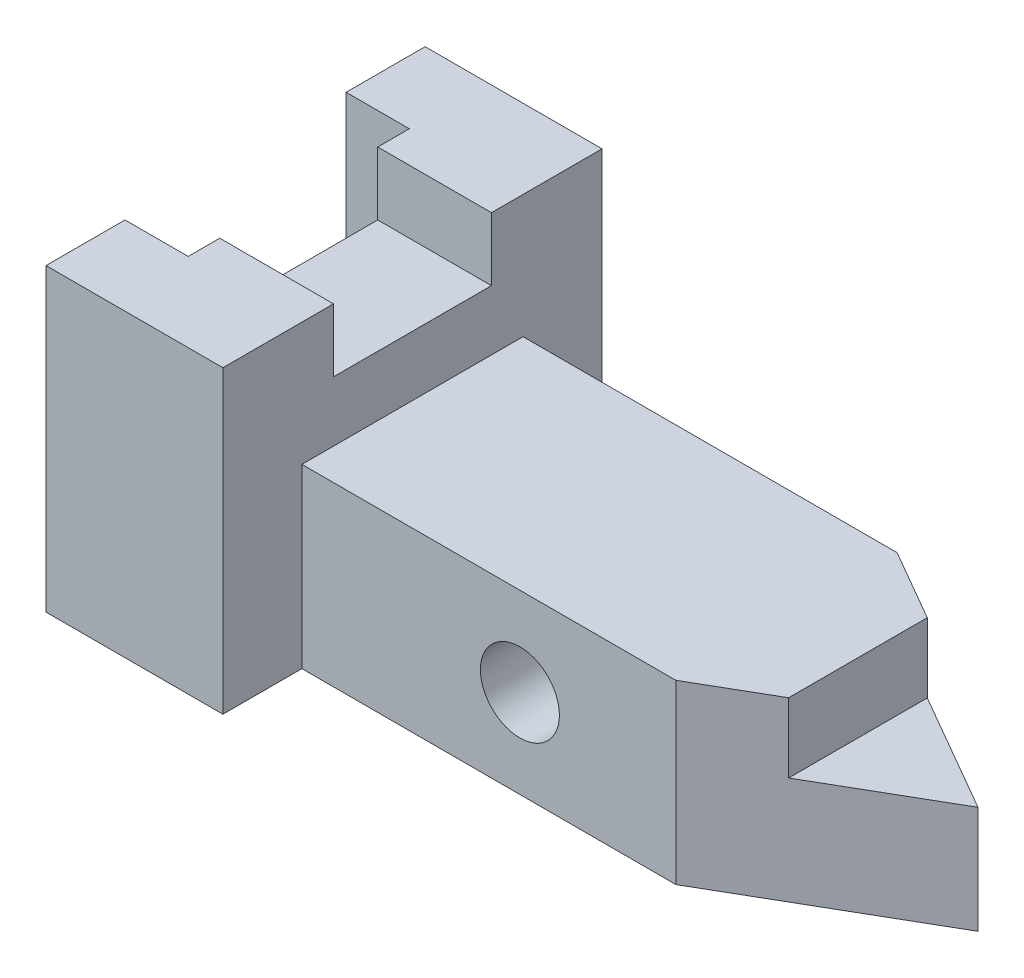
from build123d import *

# Parameters (mm, degrees)
BOSS_EXTRUDE1_DEPTH     = 28.448
CUT_EXTRUDE1_DEPTH      = 11.176
CUT_EXTRUDE2_DEPTH      = 102.697742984
CUT_EXTRUDE2_DEPTH_BACK = 102.697742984
SKETCH3_R               = 6.35
SKETCH4_W               = 60.96
SKETCH4_H               = 48.26
BOSS_EXTRUDE2_DEPTH     = 28.448
SKETCH5_W               = 25.4
SKETCH5_H               = 10.16
CUT_EXTRUDE3_DEPTH      = 28.448
SKETCH6_W               = 35.56
SKETCH6_H               = 48.26
CUT_EXTRUDE4_DEPTH      = 10.16


with BuildPart() as part:
    # Sketch1 → Boss-Extrude1 (new body)
    with BuildSketch(Plane(origin=(0, 0, 0), x_dir=(1, 0, 0), z_dir=(0, 1, 0))):
        Polygon((90.932, 17.78), (60.136136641, 35.56), (0, 35.56), (0, 0), (60.136136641, 0), align=None)
    extrude(amount=BOSS_EXTRUDE1_DEPTH)

    # Sketch2 → Cut-Extrude1 (cut)
    with BuildSketch(Plane(origin=(0, 28.448, 0), x_dir=(1, 0, 0), z_dir=(0, 1, 0))):
        Polygon((71.628, 6.634830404), (71.628, 28.925169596), (90.932, 17.78), align=None)
    extrude(amount=-CUT_EXTRUDE1_DEPTH, mode=Mode.SUBTRACT)

    # Sketch3 → Cut-Extrude2 (cut, two sides: drawn at the far end of the back side and taken through both)
    with BuildSketch(Plane.XY.offset(-CUT_EXTRUDE2_DEPTH_BACK)):
        with Locations((35.052, 14.224)):
            Circle(SKETCH3_R)
    extrude(amount=CUT_EXTRUDE2_DEPTH + CUT_EXTRUDE2_DEPTH_BACK, mode=Mode.SUBTRACT)

    # Sketch4 → Boss-Extrude2 (add)
    with BuildSketch(Plane.ZY):
        with Locations((-17.78, 24.13)):
            Rectangle(SKETCH4_W, SKETCH4_H)
    extrude(amount=BOSS_EXTRUDE2_DEPTH)

    # Sketch5 → Cut-Extrude3 (cut)
    with BuildSketch(Plane(origin=(0, 0, 0), x_dir=(0, 0, -1), z_dir=(1, 0, 0))):
        with Locations((17.78, 43.18)):
            Rectangle(SKETCH5_W, SKETCH5_H)
    extrude(amount=-CUT_EXTRUDE3_DEPTH, mode=Mode.SUBTRACT)

    # Sketch6 → Cut-Extrude4 (cut)
    with BuildSketch(Plane.ZY.offset(28.448)):
        with Locations((-17.78, 24.13)):
            Rectangle(SKETCH6_W, SKETCH6_H)
    extrude(amount=-CUT_EXTRUDE4_DEPTH, mode=Mode.SUBTRACT)


solid = part.part
